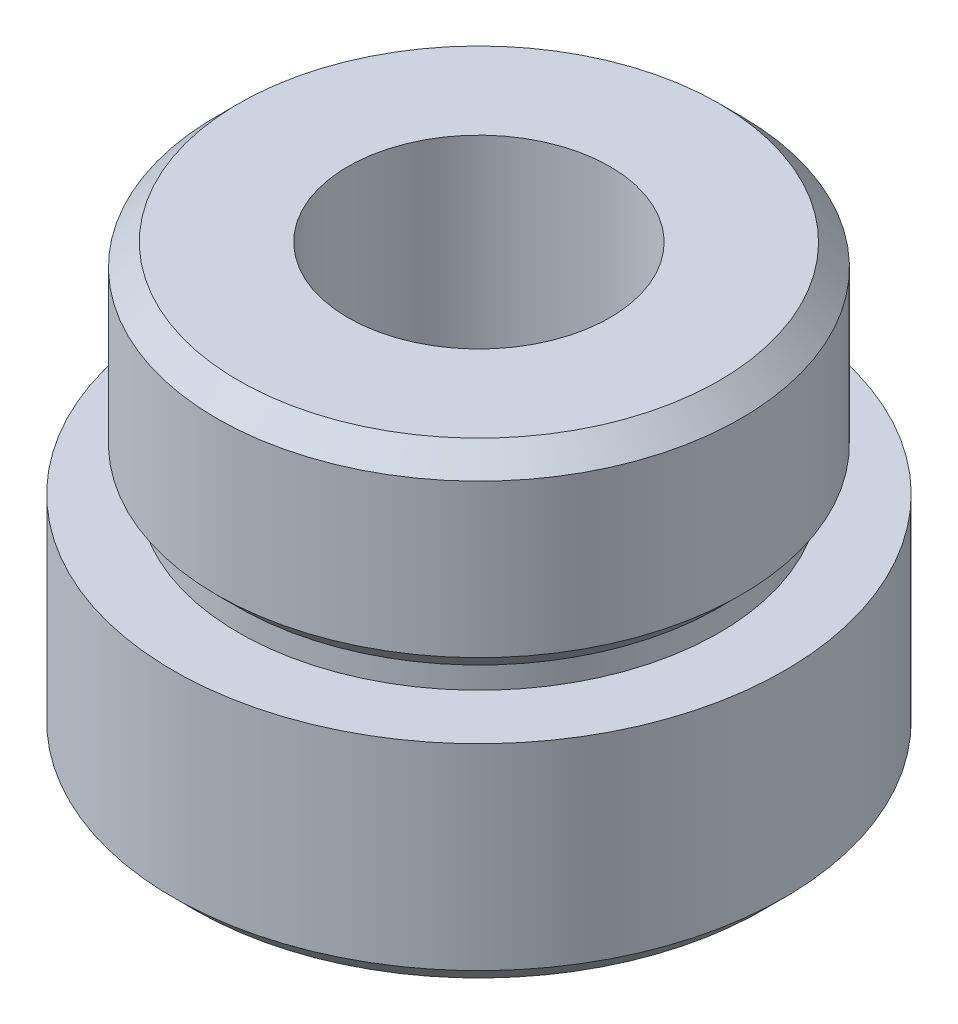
from build123d import *


with BuildPart() as part:
    # Esquisse1 → R_volution1 (revolve)
    with BuildSketch(Plane.XY, mode=Mode.PRIVATE) as r_volution1_sk:
        Polygon((-3, 1.788578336), (-6.5, 1.788578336), (-7, 2.288578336), (-7, 6.788578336), (-5.5, 6.788578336), (-5.5, 7.288578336), (-6, 7.788578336), (-6, 11.288578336), (-5.5, 11.788578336), (-3, 11.788578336), align=None)
    revolve(r_volution1_sk.sketch.rotate(Axis((0, 0, 0), (0, 1, 0)), 270), axis=Axis((0, 0, 0), (0, 1, 0)))


solid = part.part
